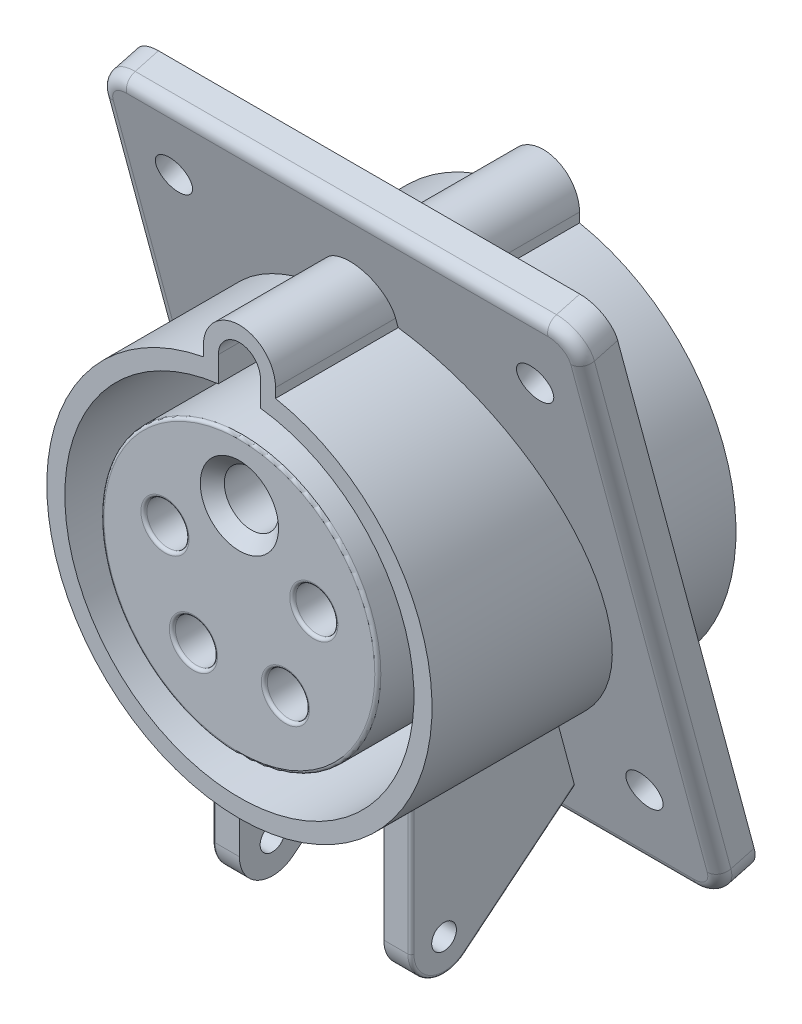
from build123d import *

# Parameters (mm, degrees)
SKETCH_1_R                    = 32
EXTRUDE_1_DEPTH               = 52
SKETCH_2_R                    = 29
CUT_EXTRUDE_1_DEPTH           = 46
SKETCH_3_R                    = 24
CUT_EXTRUDE_2_DEPTH           = 46
SKETCH_4_R                    = 48.798285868
SKETCH_4_R_2                  = 26
CUT_EXTRUDE_3_DEPTH           = 1.5
EXTRUDE_2_DEPTH               = 50.5
CUT_EXTRUDE_4_DEPTH           = 46
EXTRUDE_3_DEPTH               = 40
EXTRUDE_3_DEPTH_BACK          = 40
FILLET_1_R                    = 5
CUT_EXTRUDE_5_DEPTH           = 45
FILLET_2_R                    = 2
SKETCH_9_R                    = 3
CUT_EXTRUDE_6_DEPTH           = 40
CUT_EXTRUDE_6_DRAFT           = 4
CUT_EXTRUDE_6_PROFILE_2_DEPTH = 40
CUT_EXTRUDE_6_PROFILE_2_DRAFT = 4
CUT_EXTRUDE_6_PROFILE_3_DEPTH = 40
CUT_EXTRUDE_6_PROFILE_3_DRAFT = 4
CUT_EXTRUDE_6_PROFILE_4_DEPTH = 40
CUT_EXTRUDE_6_PROFILE_4_DRAFT = 4
SKETCH_10_R                   = 23
EXTRUDE_4_DEPTH               = 50.5
FILLET_4_R                    = 0.5
EXTRUDE_5_DEPTH               = 16.5
EXTRUDE_5_DEPTH_BACK          = 16.5
SKETCH_13_R                   = 2.054740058
CUT_EXTRUDE_9_DEPTH           = 46
CUT_EXTRUDE_START             = -19.5
CUT_EXTRUDE_10_DEPTH          = 19.5
FILLET_5_R                    = 0.5
SKETCH_16_R                   = 3.5
CUT_EXTRUDE_11_DEPTH          = 46
SKETCH_17_R                   = 4.5
CUT_EXTRUDE_12_DEPTH          = 46
FILLET_6_R                    = 0.5
CHAMFER_1_SIZE                = 2


with BuildPart() as part:
    # Sketch 1 → Extrude 1 (new body)
    with BuildSketch(Plane.XY):
        with Locations(Location((0, 0, 0), (0, 0, 180))):
            Circle(SKETCH_1_R)
    extrude(amount=EXTRUDE_1_DEPTH)

    # Sketch 2 → Cut-Extrude 1 (cut)
    with BuildSketch(Plane.XY.offset(52)):
        Circle(SKETCH_2_R)
    extrude(amount=-CUT_EXTRUDE_1_DEPTH, mode=Mode.SUBTRACT)

    # Sketch 3 → Cut-Extrude 2 (cut)
    with BuildSketch(Plane(origin=(0, 0, 0), x_dir=(-1, 0, 0), z_dir=(0, 0, -1))):
        Circle(SKETCH_3_R)
    extrude(amount=-CUT_EXTRUDE_2_DEPTH, mode=Mode.SUBTRACT)

    # Sketch 4 → Cut-Extrude 3 (cut)
    with BuildSketch(Plane(origin=(0, 0, 0), x_dir=(-1, 0, 0), z_dir=(0, 0, -1))):
        Circle(SKETCH_4_R)
        Circle(SKETCH_4_R_2, mode=Mode.SUBTRACT)
    extrude(amount=-CUT_EXTRUDE_3_DEPTH, mode=Mode.SUBTRACT)

    # Sketch 5 → Extrude 2 (add)
    with BuildSketch(Plane.XY.offset(52)):
        with BuildLine():
            Line((-6, 33), (-6, 30.53871521))
            Line((-6, 30.53871521), (6, 30.53871521))
            Line((6, 30.53871521), (6, 33))
            ThreePointArc((6, 33), (0, 39), (-6, 33))
        make_face()
    extrude(amount=-EXTRUDE_2_DEPTH)

    # Sketch 6 → Cut-Extrude 4 (cut)
    with BuildSketch(Plane.XY.offset(52)):
        with BuildLine():
            Line((-3.496275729, 33), (-3.496275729, 27.122398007))
            Line((-3.496275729, 27.122398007), (3.496275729, 27.122398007))
            Line((3.496275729, 27.122398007), (3.496275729, 33))
            ThreePointArc((3.496275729, 33), (0, 36.496275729), (-3.496275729, 33))
        make_face()
    extrude(amount=-CUT_EXTRUDE_4_DEPTH, mode=Mode.SUBTRACT)

    # Sketch 7 → Extrude 3 (add, two sides: drawn at the far end of the back side and taken through both)
    with BuildSketch(Plane(origin=(0, 0, 0), x_dir=(0, 0, -1), z_dir=(1, 0, 0)).offset(-EXTRUDE_3_DEPTH_BACK)):
        Polygon((-36.246745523, 48.628291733), (-30.45214322, 50.184757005), (-5.191197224, -43.859831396), (-10.985799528, -45.416296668), align=None)
    extrude(amount=EXTRUDE_3_DEPTH + EXTRUDE_3_DEPTH_BACK)

    # Fillet 1
    fillet_1_edges = [part.edges().sort_by_distance(p)[0] for p in [
        (-40, -44.638064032, 8.088498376),
        (-40, 49.406524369, 33.349444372),
        (40, 49.406524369, 33.349444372),
        (40, -44.638064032, 8.088498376),
    ]]
    fillet(fillet_1_edges, radius=FILLET_1_R)

    # Sketch 8 → Cut-Extrude 5 (cut)
    with BuildSketch(Plane.XY.offset(52)):
        with BuildLine():
            Line((-3.496275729, 33), (-3.496275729, 28.788470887))
            ThreePointArc((-3.496275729, 28.788470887), (0, -29), (3.496275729, 28.788470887))
            Line((3.496275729, 28.788470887), (3.496275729, 33))
            ThreePointArc((3.496275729, 33), (0, 36.496275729), (-3.496275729, 33))
        make_face()
    extrude(amount=-CUT_EXTRUDE_5_DEPTH, mode=Mode.SUBTRACT)

    # Fillet 2
    fillet_2_edges = [part.edges().sort_by_distance(p)[0] for p in [
        (0, -45.416296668, 10.985799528),
        (0, 48.628291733, 36.246745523),
        (-40, 1.605997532, 23.616272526),
        (-38.535533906, -44.001963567, 11.365697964),
        (-38.535533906, 47.213958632, 35.866847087),
        (38.535533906, 47.213958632, 35.866847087),
        (38.535533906, -44.001963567, 11.365697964),
        (40, 1.605997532, 23.616272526),
    ]]
    fillet(fillet_2_edges, radius=FILLET_2_R)


with BuildPart() as cut_extrude_6_tool:
    # Sketch 9 → Cut-Extrude 6 (with draft: the straight prism first)
    with BuildSketch(Plane(origin=(0, -5.808522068, 21.624687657), x_dir=(1, 0, 0), z_dir=(0, -0.25941087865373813, 0.9657670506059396))):
        with Locations((30, 43.351165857)):
            Circle(SKETCH_9_R)
    extrude(amount=-CUT_EXTRUDE_6_DEPTH)
    # Cut-Extrude 6: the draft: its side faces are tilted about the plane it starts from
    cut_extrude_6_sides = [cut_extrude_6_tool.faces().sort_by_distance(p)[0] for p in [
        (27, 41.246823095, 13.555110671),
    ]]
    draft(cut_extrude_6_sides, Plane(origin=(0, -5.808522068, 21.624687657), x_dir=(1, 0, 0), z_dir=(0, -0.25941087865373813, 0.9657670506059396)), CUT_EXTRUDE_6_DRAFT)


with BuildPart() as part_1:
    add(part.part)

    # Cut-Extrude 6: cut by cut_extrude_6_tool
    add(cut_extrude_6_tool.part, mode=Mode.SUBTRACT)


with BuildPart() as cut_extrude_6_profile_2_tool:
    # Sketch 9 → Cut-Extrude 6 profile 2 (with draft: the straight prism first)
    with BuildSketch(Plane(origin=(0, -5.808522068, 21.624687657), x_dir=(1, 0, 0), z_dir=(0, -0.25941087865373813, 0.9657670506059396))):
        with Locations((-30, 43.351165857)):
            Circle(SKETCH_9_R)
    extrude(amount=-CUT_EXTRUDE_6_PROFILE_2_DEPTH)
    # Cut-Extrude 6 profile 2: the draft: its side faces are tilted about the plane it starts from
    cut_extrude_6_profile_2_sides = [cut_extrude_6_profile_2_tool.faces().sort_by_distance(p)[0] for p in [
        (-33, 41.246823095, 13.555110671),
    ]]
    draft(cut_extrude_6_profile_2_sides, Plane(origin=(0, -5.808522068, 21.624687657), x_dir=(1, 0, 0), z_dir=(0, -0.25941087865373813, 0.9657670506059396)), CUT_EXTRUDE_6_PROFILE_2_DRAFT)


with BuildPart() as part_2:
    add(part_1.part)

    # Cut-Extrude 6 profile 2: cut by cut_extrude_6_profile_2_tool
    add(cut_extrude_6_profile_2_tool.part, mode=Mode.SUBTRACT)


with BuildPart() as cut_extrude_6_profile_3_tool:
    # Sketch 9 → Cut-Extrude 6 profile 3 (with draft: the straight prism first)
    with BuildSketch(Plane(origin=(0, -5.808522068, 21.624687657), x_dir=(1, 0, 0), z_dir=(0, -0.25941087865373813, 0.9657670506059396))):
        with Locations((-30, -26.648834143)):
            Circle(SKETCH_9_R)
    extrude(amount=-CUT_EXTRUDE_6_PROFILE_3_DEPTH)
    # Cut-Extrude 6 profile 3: the draft: its side faces are tilted about the plane it starts from
    cut_extrude_6_profile_3_sides = [cut_extrude_6_profile_3_tool.faces().sort_by_distance(p)[0] for p in [
        (-33, -26.356870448, -4.603650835),
    ]]
    draft(cut_extrude_6_profile_3_sides, Plane(origin=(0, -5.808522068, 21.624687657), x_dir=(1, 0, 0), z_dir=(0, -0.25941087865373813, 0.9657670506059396)), CUT_EXTRUDE_6_PROFILE_3_DRAFT)


with BuildPart() as part_3:
    add(part_2.part)

    # Cut-Extrude 6 profile 3: cut by cut_extrude_6_profile_3_tool
    add(cut_extrude_6_profile_3_tool.part, mode=Mode.SUBTRACT)


with BuildPart() as cut_extrude_6_profile_4_tool:
    # Sketch 9 → Cut-Extrude 6 profile 4 (with draft: the straight prism first)
    with BuildSketch(Plane(origin=(0, -5.808522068, 21.624687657), x_dir=(1, 0, 0), z_dir=(0, -0.25941087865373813, 0.9657670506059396))):
        with Locations((30, -26.648834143)):
            Circle(SKETCH_9_R)
    extrude(amount=-CUT_EXTRUDE_6_PROFILE_4_DEPTH)
    # Cut-Extrude 6 profile 4: the draft: its side faces are tilted about the plane it starts from
    cut_extrude_6_profile_4_sides = [cut_extrude_6_profile_4_tool.faces().sort_by_distance(p)[0] for p in [
        (27, -26.356870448, -4.603650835),
    ]]
    draft(cut_extrude_6_profile_4_sides, Plane(origin=(0, -5.808522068, 21.624687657), x_dir=(1, 0, 0), z_dir=(0, -0.25941087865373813, 0.9657670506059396)), CUT_EXTRUDE_6_PROFILE_4_DRAFT)


with BuildPart() as part_4:
    add(part_3.part)

    # Cut-Extrude 6 profile 4: cut by cut_extrude_6_profile_4_tool
    add(cut_extrude_6_profile_4_tool.part, mode=Mode.SUBTRACT)

    # Sketch 13 → Extrude 5 (add, two sides: drawn at the far end of the back side and taken through both)
    with BuildSketch(Plane(origin=(0, 0, 0), x_dir=(0, 0, -1), z_dir=(1, 0, 0)).offset(-EXTRUDE_5_DEPTH_BACK)):
        with BuildLine():
            Line((-40.000032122, -49.5), (-40.000032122, -25.24328513))
            Line((-40.000032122, -25.24328513), (-16.404392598, -25.24328513))
            Line((-16.404392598, -25.24328513), (-12.744813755, -38.867619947))
            Line((-12.744813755, -38.867619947), (-31.025694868, -53.763749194))
            ThreePointArc((-31.025694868, -53.763749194), (-36.860250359, -54.467853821), (-40.000032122, -49.5))
        make_face()
        with Locations((-34.5, -49.5)):
            Circle(SKETCH_13_R, mode=Mode.SUBTRACT)
    extrude(amount=EXTRUDE_5_DEPTH + EXTRUDE_5_DEPTH_BACK)

    # Sketch 14 → Cut-Extrude 9 (cut)
    with BuildSketch(Plane.XY.offset(52)):
        with BuildLine():
            Line((-15.463893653, -24.532998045), (15.792610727, -24.322694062))
            ThreePointArc((15.792610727, -24.322694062), (0.195117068, -28.999343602), (-15.463893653, -24.532998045))
        make_face()
    extrude(amount=-CUT_EXTRUDE_9_DEPTH, mode=Mode.SUBTRACT)

    # Sketch 15 → Cut-Extrude 10 (cut)
    with BuildSketch(Plane.XY.offset(40.000032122).offset(CUT_EXTRUDE_START)):
        with BuildLine():
            Line((-12, -60.389019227), (12, -60.389019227))
            Line((12, -60.389019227), (12, -29.664793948))
            ThreePointArc((12, -29.664793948), (0, -32), (-12, -29.664793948))
            Line((-12, -29.664793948), (-12, -60.389019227))
        make_face()
    extrude(amount=CUT_EXTRUDE_10_DEPTH, mode=Mode.SUBTRACT)

    # Fillet 5
    fillet_5_edges = [part_4.edges().sort_by_distance(p)[0] for p in [
        (16.5, -38.459029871, 40.000032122),
        (16.5, -54.467853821, 36.860250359),
        (16.5, -46.315684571, 21.885254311),
        (-16.5, -38.459029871, 40.000032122),
        (-16.5, -54.467853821, 36.860250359),
        (-16.5, -46.315684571, 21.885254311),
    ]]
    fillet(fillet_5_edges, radius=FILLET_5_R)


with BuildPart() as body_2:
    # Sketch 10 → Extrude 4 (new body)
    with BuildSketch(Plane(origin=(0, 0, 1.5), x_dir=(-1, 0, 0), z_dir=(0, 0, -1))):
        Circle(SKETCH_10_R)
    extrude(amount=-EXTRUDE_4_DEPTH)

    # Fillet 4
    fillet_4_edges = [body_2.edges().sort_by_distance(p)[0] for p in [
        (23, 0, 52),
    ]]
    fillet(fillet_4_edges, radius=FILLET_4_R)

    # Sketch 16 → Cut-Extrude 11 (cut)
    with BuildSketch(Plane.XY.offset(52)):
        with Locations((0, 13)):
            Circle(SKETCH_16_R)
        with Locations((12.363734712, 4.017220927)):
            Circle(SKETCH_16_R)
        with Locations((7.64120828, -10.517220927)):
            Circle(SKETCH_16_R)
        with Locations((-7.64120828, -10.517220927)):
            Circle(SKETCH_16_R)
        with Locations((-12.363734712, 4.017220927)):
            Circle(SKETCH_16_R)
    extrude(amount=-CUT_EXTRUDE_11_DEPTH, mode=Mode.SUBTRACT)

    # Sketch 17 → Cut-Extrude 12 (cut)
    with BuildSketch(Plane.XY.offset(52)):
        with Locations((0, 13)):
            Circle(SKETCH_17_R)
    extrude(amount=-CUT_EXTRUDE_12_DEPTH, mode=Mode.SUBTRACT)

    # Fillet 6
    fillet_6_edges = [body_2.edges().sort_by_distance(p)[0] for p in [
        (8.863734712, 4.017220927, 52),
        (4.14120828, -10.517220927, 52),
        (-11.14120828, -10.517220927, 52),
        (-15.863734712, 4.017220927, 52),
    ]]
    fillet(fillet_6_edges, radius=FILLET_6_R)

    # Chamfer 1
    chamfer_1_edges = [body_2.edges().sort_by_distance(p)[0] for p in [
        (-4.5, 13, 52),
    ]]
    chamfer(chamfer_1_edges, length=CHAMFER_1_SIZE)


solid = Compound([part_4.part, body_2.part])
